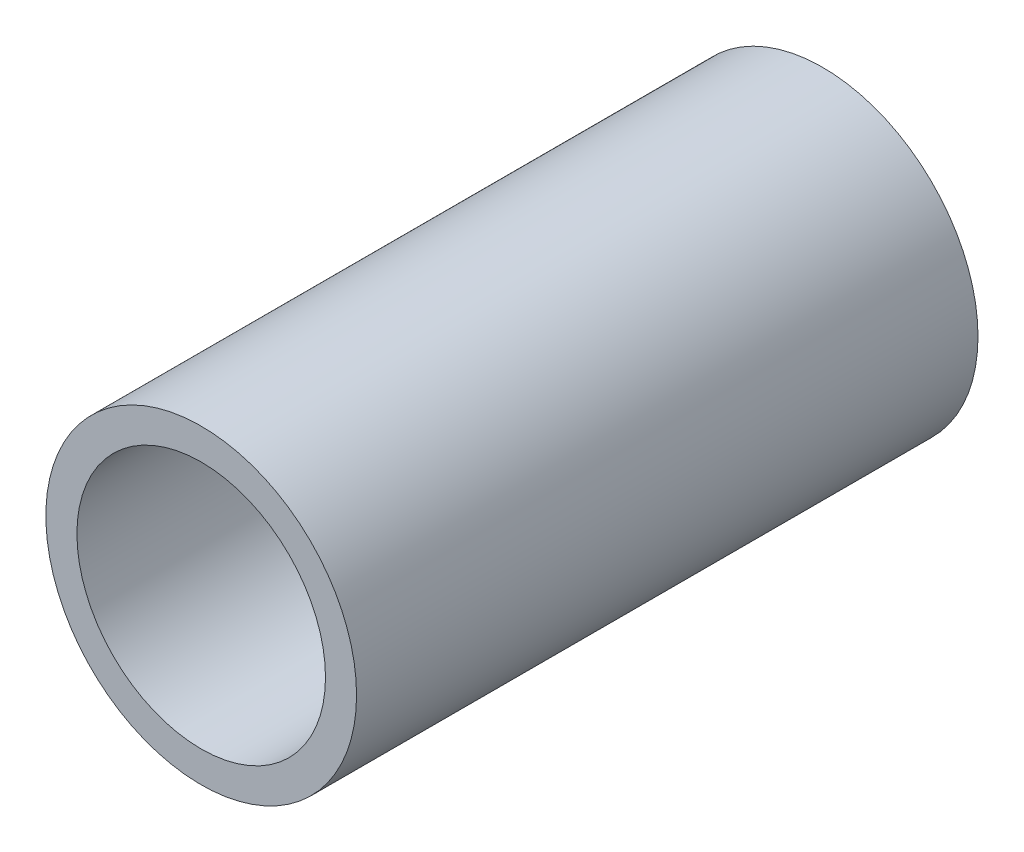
from build123d import *

# Parameters (mm, degrees)
ESQUISSE1_R      = 5
ESQUISSE1_R_2    = 4
EXTRUSION1_DEPTH = 20


with BuildPart() as part:
    # Esquisse1 → Extrusion1 (new body)
    with BuildSketch(Plane.XY):
        Circle(ESQUISSE1_R)
        Circle(ESQUISSE1_R_2, mode=Mode.SUBTRACT)
    extrude(amount=EXTRUSION1_DEPTH)


solid = part.part
